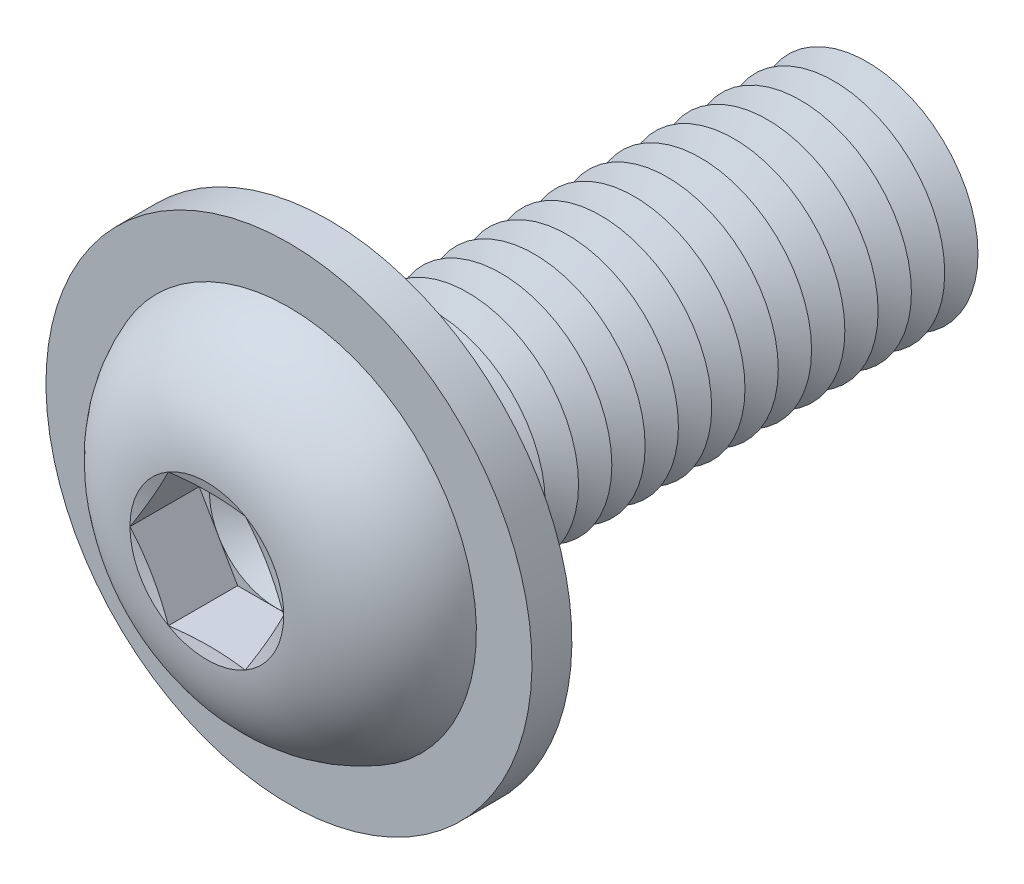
from build123d import *

# Parameters (mm, degrees)
FILLET1_R           = 0.75
LPATTERN1_COUNT     = 16
LPATTERN1_PITCH     = 1.5
CUT_EXTRUDE1_DEPTH  = 3.12
SKETCH5_R           = 10.95
SKETCH5_R_2         = 5.75
BOSS_EXTRUDE1_DEPTH = 1.8


with BuildPart() as part:
    # Sketch1 → Revolve1 (revolve)
    with BuildSketch(Plane(origin=(0, 0, 0), x_dir=(0, 0, -1), z_dir=(1, 0, 0)), mode=Mode.PRIVATE) as revolve1_sk:
        with BuildLine():
            Line((0, 5), (0, 8.75))
            ThreePointArc((0, 8.75), (-3.814142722, 7.21429474), (-5.5, 3.4641))
            Line((-5.5, 3.4641), (-5.035898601, 1.73205))
            Line((-5.035898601, 1.73205), (-5.5, 1.73205))
            Line((-5.5, 1.73205), (-5.5, 0))
            Line((-5.5, 0), (25, 0))
            Line((25, 0), (25, 5))
            Line((25, 5), (0, 5))
        make_face()
    revolve(revolve1_sk.sketch.rotate(Axis((0, 0, -25), (0, 0, 1)), 90), axis=Axis((0, 0, -25), (0, 0, 1)))

    # Fillet1
    fillet1_edges = [part.edges().sort_by_distance(p)[0] for p in [
        (5, 0, 0),
    ]]
    fillet(fillet1_edges, radius=FILLET1_R)

    # Sketch2 → Cut-Revolve1 (revolve, cut)
    with BuildSketch(Plane(origin=(0, 0, 0), x_dir=(0, 0, -1), z_dir=(1, 0, 0)), mode=Mode.PRIVATE) as cut_revolve1_sk:
        Polygon((24.25, 5), (25.75, 5), (25, 3.700961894), align=None)
    cut_revolve1 = revolve(cut_revolve1_sk.sketch.rotate(Axis((0, 0, -25), (0, 0, -1)), 270), axis=Axis((0, 0, -25), (0, 0, -1)), mode=Mode.SUBTRACT)

    # LPattern1: Cut-Revolve1 ×16
    with Locations(*[(0, 0, i * LPATTERN1_PITCH) for i in range(1, LPATTERN1_COUNT)]):
        add(cut_revolve1, mode=Mode.SUBTRACT)

    # Sketch3 → Cut-Extrude1 (cut)
    with BuildSketch(Plane.XY.offset(5.5)):
        Polygon((1.73205, 2.999998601), (-1.73205, 2.999998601), (-3.4641, 0), (-1.73205, -2.999998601), (1.73205, -2.999998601), (3.4641, 0), align=None)
    extrude(amount=-CUT_EXTRUDE1_DEPTH, mode=Mode.SUBTRACT)

    # Cut-Extrude2 cone 1 section (on through the dimple's axis) → Cut-Extrude2 (revolve, cut)
    with BuildSketch(Plane(origin=(0, 0, 2.38), x_dir=(0, -1, 0), z_dir=(1, 0, 0))):
        Polygon((0, 0), (2.999998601, 0), (0, 1.73205), align=None)
    revolve(axis=Axis((0, 0, 2.38), (0, 0, -1)), mode=Mode.SUBTRACT)

    # Sketch5 → Boss-Extrude1 (add)
    with BuildSketch(Plane(origin=(0, 0, 0), x_dir=(-1, 0, 0), z_dir=(0, 0, -1))):
        with Locations(Location((0, 0, 0), (0, 0, 90))):
            Circle(SKETCH5_R)
        Circle(SKETCH5_R_2, mode=Mode.SUBTRACT)
    extrude(amount=-BOSS_EXTRUDE1_DEPTH)


solid = part.part
